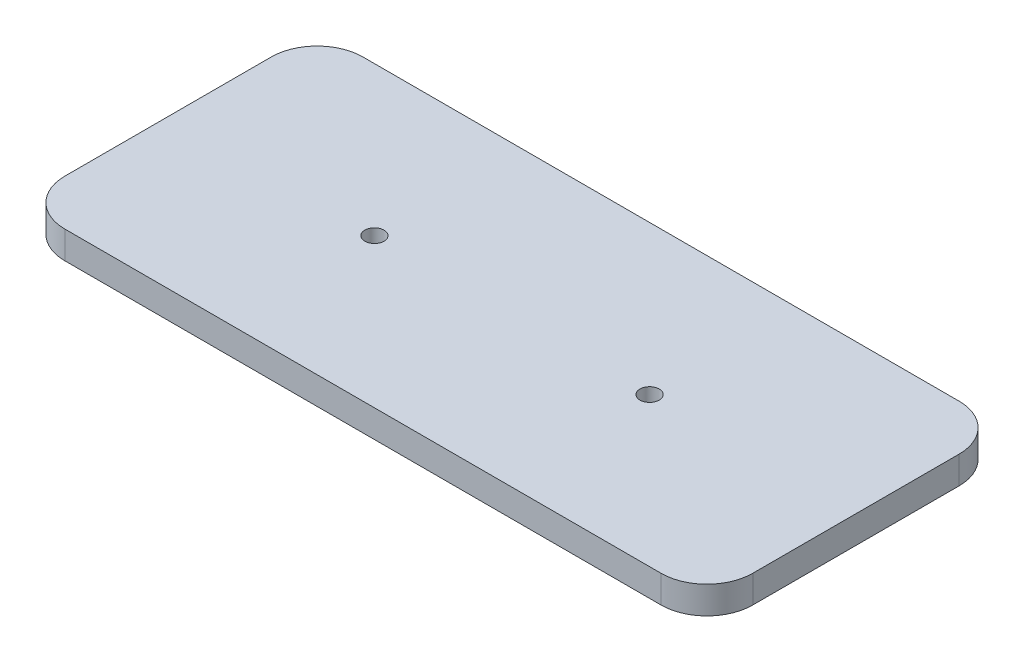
from build123d import *

# Parameters (mm, degrees)
EXTRUDE1_DEPTH    = 6
M5_TAPPED_HOLE1_D = 4.2


with BuildPart() as part:
    # Sketch1 → Extrude1 (new body)
    with BuildSketch(Plane(origin=(0, 0, 0), x_dir=(1, 0, 0), z_dir=(0, 1, 0))):
        with BuildLine():
            Line((10, 0), (140, 0))
            ThreePointArc((140, 0), (147.071067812, 2.928932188), (150, 10))
            Line((150, 10), (150, 55))
            ThreePointArc((150, 55), (147.071067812, 62.071067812), (140, 65))
            Line((140, 65), (10, 65))
            ThreePointArc((10, 65), (2.928932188, 62.071067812), (0, 55))
            Line((0, 55), (0, 10))
            ThreePointArc((0, 10), (2.928932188, 2.928932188), (10, 0))
        make_face()
    extrude(amount=EXTRUDE1_DEPTH)

    # M5 Tapped Hole1 (through all)
    with Locations(Plane(origin=(45, 6, -32.5), x_dir=(0, 0, 1), z_dir=(0, 1, 0))):
        with Locations((0, 0), (0, 60)):
            Hole(M5_TAPPED_HOLE1_D / 2)


solid = part.part
